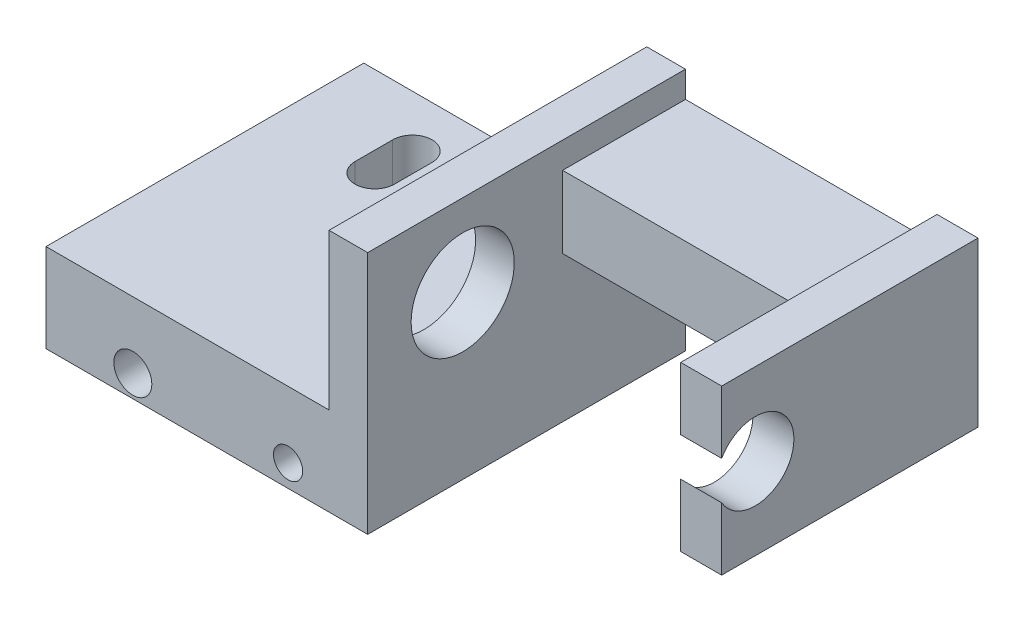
from build123d import *

# Parameters (mm, degrees)
SKETCH1_W                 = 47.625
SKETCH1_H                 = 24.638
EXTRUDE1_DEPTH            = 18.923
SKETCH2_W                 = 19.5072
SKETCH2_H                 = 15.113
CUT_EXTRUDE1_DEPTH        = 33.81574083
SKETCH4_W                 = 19.5072
SKETCH4_H                 = 2.032
CUT_EXTRUDE2_DEPTH        = 40.142638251
CUT_EXTRUDE3_DEPTH        = 3.429
CUT_EXTRUDE4_REACH        = 54.707
SKETCH6_R                 = 2.99974
SKETCH7_R                 = 5.55625
CUT_EXTRUDE5_DEPTH        = 21.9456
M8X_75_TAPPED_HOLE1_D     = 8
M8X_75_TAPPED_HOLE1_DEPTH = 2.9972
CUT_EXTRUDE6_DEPTH        = 10.16
CUT_EXTRUDE7_DEPTH        = 31.965415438
F_4_40_TAPPED_HOLE2_D     = 2.2606
F_4_CLEARANCE_HOLE1_D     = 2.9464
SKETCH16_W                = 5.876066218
SKETCH16_H                = 13.263120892
CUT_EXTRUDE8_DEPTH        = 3.175
SKETCH17_W                = 21.9456
SKETCH17_H                = 12.065
EXTRUDE2_DEPTH            = 40.142638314


with BuildPart() as part:
    # Sketch1 → Extrude1 (new body)
    with BuildSketch(Plane(origin=(0, 0, 0), x_dir=(1, 0, 0), z_dir=(0, 1, 0))):
        Rectangle(SKETCH1_W, SKETCH1_H)
    extrude(amount=EXTRUDE1_DEPTH)

    # Sketch2 → Cut-Extrude1 (cut, through all)
    with BuildSketch(Plane(origin=(0, 18.923, 0), x_dir=(1, 0, 0), z_dir=(0, 1, 0))):
        with Locations((10.8839, -4.7625)):
            Rectangle(SKETCH2_W, SKETCH2_H)
    extrude(amount=-CUT_EXTRUDE1_DEPTH, mode=Mode.SUBTRACT)

    # Sketch4 → Cut-Extrude2 (cut, through all)
    with BuildSketch(Plane(origin=(0, 0, -12.319), x_dir=(-1, 0, 0), z_dir=(0, 0, -1))):
        Polygon((-1.1303, 0), (-20.770679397, 0), (-23.8125, 0), (-23.8125, 6.223), (-20.6375, 6.223), (-20.6375, 11.303), (-1.1303, 11.303), align=None)
        with Locations((-10.8839, 17.907)):
            Rectangle(SKETCH4_W, SKETCH4_H)
    extrude(amount=-CUT_EXTRUDE2_DEPTH, mode=Mode.SUBTRACT)

    # Sketch5 → Cut-Extrude3 (cut)
    with BuildSketch(Plane.XZ):
        with BuildLine():
            Line((-20.2565, -12.319), (-1.8669, -12.319))
            Line((-1.8669, -12.319), (-1.8669, -1.3462))
            ThreePointArc((-1.8669, -1.3462), (-2.79683597, 0.89886403), (-5.0419, 1.8288))
            Line((-5.0419, 1.8288), (-17.0815, 1.8288))
            ThreePointArc((-17.0815, 1.8288), (-19.32656403, 0.89886403), (-20.2565, -1.3462))
            Line((-20.2565, -1.3462), (-20.2565, -12.319))
        make_face()
    extrude(amount=-CUT_EXTRUDE3_DEPTH, mode=Mode.SUBTRACT)

    # Sketch6 → Cut-Extrude4 (cut, up to next)
    with BuildSketch(Plane(origin=(23.8125, 0, 0), x_dir=(0, 0, -1), z_dir=(1, 0, 0)), mode=Mode.PRIVATE) as cut_extrude4_sk1:
        with Locations((-4.953, 12.573)):
            Circle(SKETCH6_R)
    cut_extrude4_tool1 = extrude(cut_extrude4_sk1.sketch, amount=-CUT_EXTRUDE4_REACH, mode=Mode.PRIVATE) & part.part
    add(cut_extrude4_tool1.solids().sort_by_distance((23.8125, 12.573, 4.953))[0], mode=Mode.SUBTRACT)

    # Sketch7 → Cut-Extrude5 (cut)
    with BuildSketch(Plane.ZY.offset(23.8125)):
        with Locations((4.953, 12.573)):
            Circle(SKETCH7_R)
    extrude(amount=-CUT_EXTRUDE5_DEPTH, mode=Mode.SUBTRACT)

    # M8x.75 Tapped Hole1
    with Locations(Plane(origin=(-1.8669, 12.573, 4.953), x_dir=(0, 0, -1), z_dir=(-1, 0, 0))):
        with Locations((0, 0)):
            Hole(M8X_75_TAPPED_HOLE1_D / 2, depth=M8X_75_TAPPED_HOLE1_DEPTH)

    # Sketch9 → Cut-Extrude6 (cut)
    with BuildSketch(Plane(origin=(0, 18.923, 0), x_dir=(1, 0, 0), z_dir=(0, 1, 0))):
        with BuildLine():
            Line((-23.8125, 12.319), (-1.8669, 12.319))
            Line((-1.8669, 12.319), (-1.8669, 4.51104))
            ThreePointArc((-1.8669, 4.51104), (-2.79683597, 2.26597597), (-5.0419, 1.33604))
            Line((-5.0419, 1.33604), (-23.8125, 1.33604))
            Line((-23.8125, 1.33604), (-23.8125, 12.319))
        make_face()
    extrude(amount=-CUT_EXTRUDE6_DEPTH, mode=Mode.SUBTRACT)

    # Sketch11 → Cut-Extrude7 (cut, through all)
    with BuildSketch(Plane.XZ.offset(-3.429)):
        with BuildLine():
            Line((-17.54124, -5.371346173), (-17.54124, -8.293853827))
            ThreePointArc((-17.54124, -8.293853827), (-16.01724, -9.817853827), (-14.49324, -8.293853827))
            Line((-14.49324, -8.293853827), (-14.49324, -5.371346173))
            ThreePointArc((-14.49324, -5.371346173), (-16.01724, -3.847346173), (-17.54124, -5.371346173))
        make_face()
        with BuildLine():
            Line((-7.45744, -5.371346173), (-7.45744, -8.293853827))
            ThreePointArc((-7.45744, -8.293853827), (-5.93344, -9.817853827), (-4.40944, -8.293853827))
            Line((-4.40944, -8.293853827), (-4.40944, -5.371346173))
            ThreePointArc((-4.40944, -5.371346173), (-5.93344, -3.847346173), (-7.45744, -5.371346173))
        make_face()
    extrude(amount=-CUT_EXTRUDE7_DEPTH, mode=Mode.SUBTRACT)

    # 4-40 Tapped Hole2 (through all)
    with Locations(Plane(origin=(-5.0419, 1.7145, 12.319), x_dir=(1, 0, 0), z_dir=(0, 0, 1))):
        with Locations((0, 0)):
            Hole(F_4_40_TAPPED_HOLE2_D / 2)

    # 4 Clearance Hole1 (through all)
    with Locations(Plane(origin=(-17.0815, 1.7145, 12.319), x_dir=(1, 0, 0), z_dir=(0, 0, 1))):
        with Locations((0, 0)):
            Hole(F_4_CLEARANCE_HOLE1_D / 2)

    # Sketch16 → Cut-Extrude8 (cut)
    with BuildSketch(Plane(origin=(23.8125, 0, 0), x_dir=(0, 0, -1), z_dir=(1, 0, 0))):
        with Locations((-10.494533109, 12.483476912)):
            Rectangle(SKETCH16_W, SKETCH16_H)
    extrude(amount=-CUT_EXTRUDE8_DEPTH, mode=Mode.SUBTRACT)

    # Sketch17 → Extrude2 (cut, through all)
    with BuildSketch(Plane(origin=(0, 0, -12.319), x_dir=(-1, 0, 0), z_dir=(0, 0, -1))):
        with Locations((12.8397, 12.8905)):
            Rectangle(SKETCH17_W, SKETCH17_H)
    extrude(amount=-EXTRUDE2_DEPTH, mode=Mode.SUBTRACT)


solid = part.part
